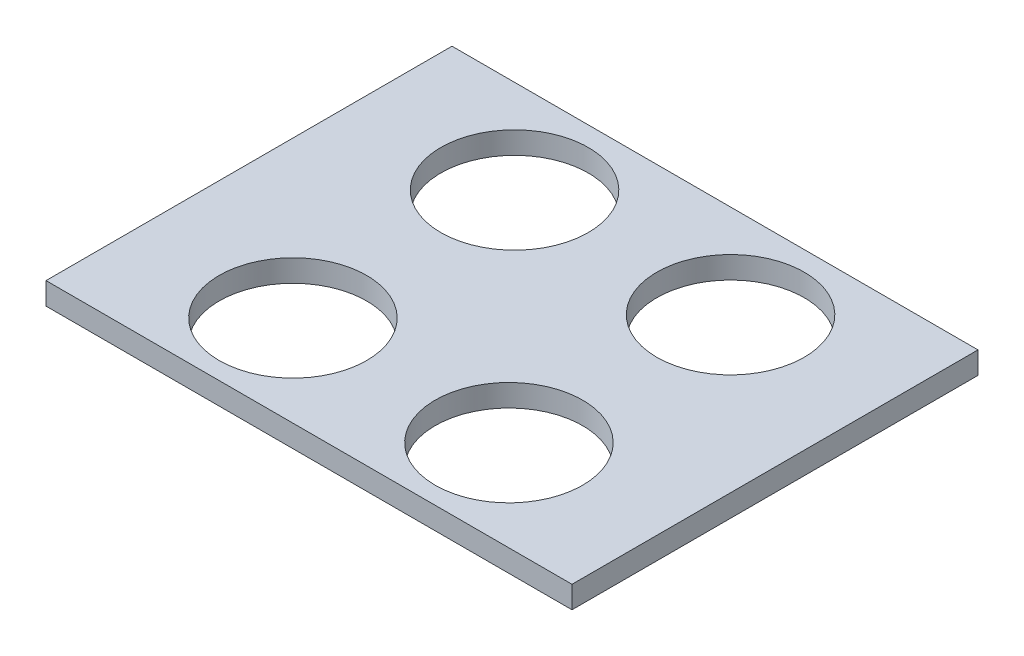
from build123d import *

# Parameters (mm, degrees)
SKETCH_3_W          = 71.326490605
SKETCH_3_H          = 55.052970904
EXTRUDE_1_DEPTH     = 3
SKETCH_9_R          = 10
CUT_EXTRUDE_2_DEPTH = 3


with BuildPart() as part:
    # Sketch 3 → Extrude 1 (new body)
    with BuildSketch(Plane(origin=(0, 0, 0), x_dir=(1, 0, 0), z_dir=(0, 1, 0))):
        with Locations((3.289328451, -0.709418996)):
            Rectangle(SKETCH_3_W, SKETCH_3_H)
    extrude(amount=EXTRUDE_1_DEPTH)

    # Sketch 9 → Cut-Extrude 2 (cut)
    with BuildSketch(Plane(origin=(0, 3, 0), x_dir=(1, 0, 0), z_dir=(0, 1, 0))):
        with Locations(Location((-11.243679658, 14.168993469, 0), (0, 0, 270))):
            Circle(SKETCH_9_R)
        with Locations(Location((18.045459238, 14.168993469, 0), (0, 0, 270))):
            Circle(SKETCH_9_R)
        with Locations(Location((18.045459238, -15.88420992, 0), (0, 0, 270))):
            Circle(SKETCH_9_R)
        with Locations(Location((-11.243679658, -15.88420992, 0), (0, 0, 270))):
            Circle(SKETCH_9_R)
    extrude(amount=-CUT_EXTRUDE_2_DEPTH, mode=Mode.SUBTRACT)


solid = part.part
